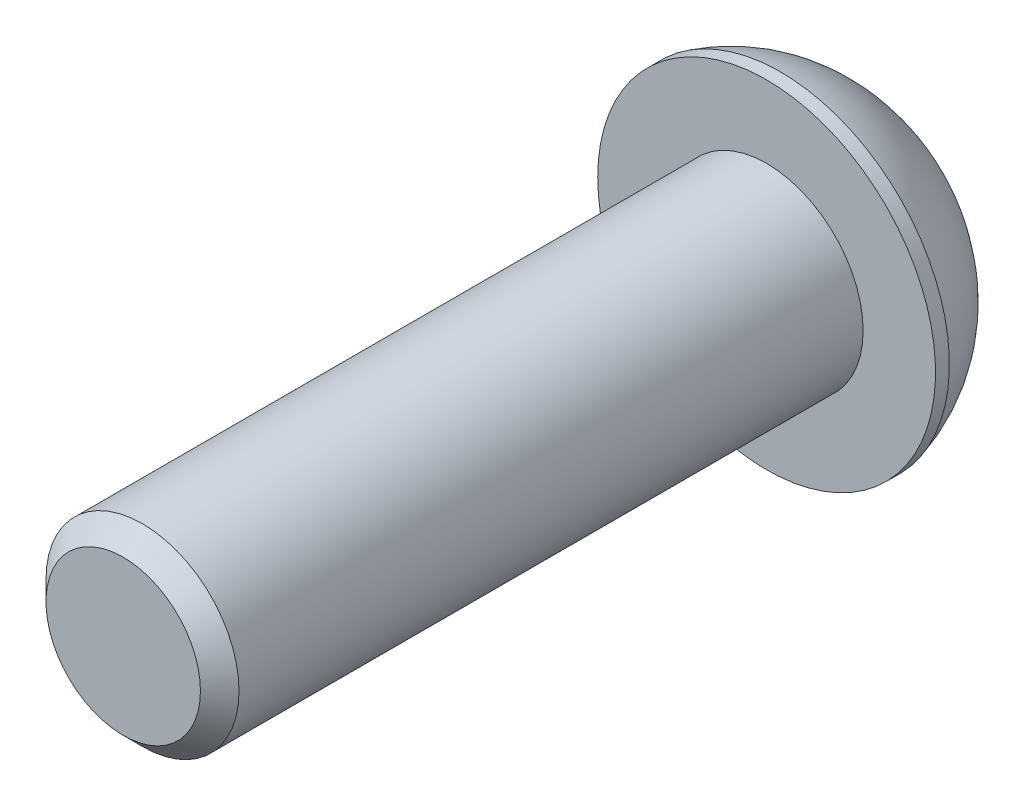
ISO-10303-21;
HEADER;
FILE_DESCRIPTION(('STEP AP214'),'2;1');
FILE_NAME('part.step','',(''),(''),'','','');
FILE_SCHEMA(('AUTOMOTIVE_DESIGN { 1 0 10303 214 1 1 1 1 }'));
ENDSEC;
DATA;
#1=APPLICATION_CONTEXT('core data for automotive mechanical design processes');
#2=APPLICATION_PROTOCOL_DEFINITION('international standard','automotive_design',2000,#1);
#3=PRODUCT_CONTEXT('',#1,'mechanical');
#4=PRODUCT('Part','Part','',(#3));
#5=PRODUCT_RELATED_PRODUCT_CATEGORY('part','',(#4));
#6=PRODUCT_DEFINITION_FORMATION('','',#4);
#7=PRODUCT_DEFINITION_CONTEXT('part definition',#1,'design');
#8=PRODUCT_DEFINITION('design','',#6,#7);
#9=PRODUCT_DEFINITION_SHAPE('','',#8);
#10=(LENGTH_UNIT() NAMED_UNIT(*) SI_UNIT(.MILLI.,.METRE.));
#11=(NAMED_UNIT(*) PLANE_ANGLE_UNIT() SI_UNIT($,.RADIAN.));
#12=(NAMED_UNIT(*) SI_UNIT($,.STERADIAN.) SOLID_ANGLE_UNIT());
#13=UNCERTAINTY_MEASURE_WITH_UNIT(LENGTH_MEASURE(1.E-05),#10,'distance_accuracy_value','');
#14=(GEOMETRIC_REPRESENTATION_CONTEXT(3) GLOBAL_UNCERTAINTY_ASSIGNED_CONTEXT((#13)) GLOBAL_UNIT_ASSIGNED_CONTEXT((#10,
#11,#12)) REPRESENTATION_CONTEXT('',''));
#15=CARTESIAN_POINT('',(0.,0.,0.));
#16=DIRECTION('',(0.,0.,1.));
#17=DIRECTION('',(1.,0.,0.));
#18=AXIS2_PLACEMENT_3D('',#15,#16,#17);
#19=CARTESIAN_POINT('',(0.,0.,-3.3));
#20=DIRECTION('',(0.,0.,1.));
#21=DIRECTION('',(1.,0.,0.));
#22=AXIS2_PLACEMENT_3D('',#19,#20,#21);
#23=PLANE('',#22);
#24=CARTESIAN_POINT('',(0.,0.,-3.3));
#25=DIRECTION('',(0.,0.,-1.));
#26=DIRECTION('',(-1.,0.,0.));
#27=AXIS2_PLACEMENT_3D('',#24,#25,#26);
#28=CIRCLE('',#27,3.04869256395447);
#29=CARTESIAN_POINT('',(-3.04869256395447,0.,-3.3));
#30=VERTEX_POINT('',#29);
#31=EDGE_CURVE('E141',#30,#30,#28,.T.);
#32=ORIENTED_EDGE('',*,*,#31,.T.);
#33=EDGE_LOOP('',(#32));
#34=FACE_BOUND('',#33,.T.);
#35=DIRECTION('',(-0.86602540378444,0.499999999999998,0.));
#36=VECTOR('',#35,1.);
#37=CARTESIAN_POINT('',(0.,2.30940107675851,-3.3));
#38=LINE('',#37,#36);
#39=CARTESIAN_POINT('',(2.,1.15470053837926,-3.3));
#40=VERTEX_POINT('',#39);
#41=CARTESIAN_POINT('',(0.,2.30940107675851,-3.3));
#42=VERTEX_POINT('',#41);
#43=EDGE_CURVE('E45',#40,#42,#38,.T.);
#44=ORIENTED_EDGE('',*,*,#43,.T.);
#45=DIRECTION('',(-0.866025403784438,-0.500000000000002,0.));
#46=VECTOR('',#45,1.);
#47=CARTESIAN_POINT('',(0.,2.30940107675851,-3.3));
#48=LINE('',#47,#46);
#49=CARTESIAN_POINT('',(-2.,1.15470053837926,-3.3));
#50=VERTEX_POINT('',#49);
#51=EDGE_CURVE('E85',#42,#50,#48,.T.);
#52=ORIENTED_EDGE('',*,*,#51,.T.);
#53=DIRECTION('',(0.,-1.,0.));
#54=VECTOR('',#53,1.);
#55=CARTESIAN_POINT('',(-2.,-1.15470053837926,-3.3));
#56=LINE('',#55,#54);
#57=CARTESIAN_POINT('',(-2.,-1.15470053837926,-3.3));
#58=VERTEX_POINT('',#57);
#59=EDGE_CURVE('E93',#50,#58,#56,.T.);
#60=ORIENTED_EDGE('',*,*,#59,.T.);
#61=DIRECTION('',(0.866025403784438,-0.500000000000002,0.));
#62=VECTOR('',#61,1.);
#63=CARTESIAN_POINT('',(0.,-2.30940107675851,-3.3));
#64=LINE('',#63,#62);
#65=CARTESIAN_POINT('',(0.,-2.30940107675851,-3.3));
#66=VERTEX_POINT('',#65);
#67=EDGE_CURVE('E111',#58,#66,#64,.T.);
#68=ORIENTED_EDGE('',*,*,#67,.T.);
#69=DIRECTION('',(0.86602540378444,0.499999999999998,0.));
#70=VECTOR('',#69,1.);
#71=CARTESIAN_POINT('',(0.,-2.30940107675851,-3.3));
#72=LINE('',#71,#70);
#73=CARTESIAN_POINT('',(2.,-1.15470053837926,-3.3));
#74=VERTEX_POINT('',#73);
#75=EDGE_CURVE('E114',#66,#74,#72,.T.);
#76=ORIENTED_EDGE('',*,*,#75,.T.);
#77=DIRECTION('',(0.,1.,0.));
#78=VECTOR('',#77,1.);
#79=CARTESIAN_POINT('',(2.,-1.15470053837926,-3.3));
#80=LINE('',#79,#78);
#81=EDGE_CURVE('E104',#74,#40,#80,.T.);
#82=ORIENTED_EDGE('',*,*,#81,.T.);
#83=EDGE_LOOP('',(#44,#52,#60,#68,#76,#82));
#84=FACE_BOUND('',#83,.T.);
#85=ADVANCED_FACE('F31',(#34,#84),#23,.F.);
#86=CARTESIAN_POINT('',(0.,0.,0.791612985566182));
#87=DIRECTION('',(0.,0.,-1.));
#88=DIRECTION('',(-1.,0.,0.));
#89=AXIS2_PLACEMENT_3D('',#86,#87,#88);
#90=DEGENERATE_TOROIDAL_SURFACE('',#89,0.686398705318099,4.72458771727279,.T.);
#91=ORIENTED_EDGE('',*,*,#31,.F.);
#92=EDGE_LOOP('',(#91));
#93=FACE_BOUND('',#92,.T.);
#94=CARTESIAN_POINT('',(0.,0.,-0.431200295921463));
#95=DIRECTION('',(0.,0.,-1.));
#96=DIRECTION('',(-1.,0.,0.));
#97=AXIS2_PLACEMENT_3D('',#94,#95,#96);
#98=CIRCLE('',#97,5.25);
#99=CARTESIAN_POINT('',(-5.25,0.,-0.431200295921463));
#100=VERTEX_POINT('',#99);
#101=EDGE_CURVE('E138',#100,#100,#98,.T.);
#102=ORIENTED_EDGE('',*,*,#101,.T.);
#103=EDGE_LOOP('',(#102));
#104=FACE_BOUND('',#103,.T.);
#105=ADVANCED_FACE('F160',(#93,#104),#90,.T.);
#106=CARTESIAN_POINT('',(0.,0.,0.));
#107=DIRECTION('',(0.,0.,-1.));
#108=DIRECTION('',(-1.,0.,0.));
#109=AXIS2_PLACEMENT_3D('',#106,#107,#108);
#110=CYLINDRICAL_SURFACE('',#109,5.25);
#111=ORIENTED_EDGE('',*,*,#101,.F.);
#112=EDGE_LOOP('',(#111));
#113=FACE_BOUND('',#112,.T.);
#114=CARTESIAN_POINT('',(0.,0.,0.));
#115=DIRECTION('',(0.,0.,-1.));
#116=DIRECTION('',(-1.,0.,0.));
#117=AXIS2_PLACEMENT_3D('',#114,#115,#116);
#118=CIRCLE('',#117,5.25);
#119=CARTESIAN_POINT('',(-5.25,0.,0.));
#120=VERTEX_POINT('',#119);
#121=EDGE_CURVE('E99',#120,#120,#118,.T.);
#122=ORIENTED_EDGE('',*,*,#121,.T.);
#123=EDGE_LOOP('',(#122));
#124=FACE_BOUND('',#123,.T.);
#125=ADVANCED_FACE('F165',(#113,#124),#110,.T.);
#126=CARTESIAN_POINT('',(0.,0.,0.));
#127=DIRECTION('',(0.,0.,-1.));
#128=DIRECTION('',(-1.,0.,0.));
#129=AXIS2_PLACEMENT_3D('',#126,#127,#128);
#130=PLANE('',#129);
#131=CARTESIAN_POINT('',(0.,0.,0.));
#132=DIRECTION('',(0.,0.,1.));
#133=DIRECTION('',(1.,0.,0.));
#134=AXIS2_PLACEMENT_3D('',#131,#132,#133);
#135=CIRCLE('',#134,3.);
#136=CARTESIAN_POINT('',(3.,0.,0.));
#137=VERTEX_POINT('',#136);
#138=EDGE_CURVE('E105',#137,#137,#135,.T.);
#139=ORIENTED_EDGE('',*,*,#138,.F.);
#140=EDGE_LOOP('',(#139));
#141=FACE_BOUND('',#140,.T.);
#142=ORIENTED_EDGE('',*,*,#121,.F.);
#143=EDGE_LOOP('',(#142));
#144=FACE_BOUND('',#143,.T.);
#145=ADVANCED_FACE('F173',(#141,#144),#130,.F.);
#146=CARTESIAN_POINT('',(0.,2.30940107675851,-1.22));
#147=DIRECTION('',(-0.499999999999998,-0.86602540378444,0.));
#148=DIRECTION('',(0.86602540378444,-0.499999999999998,0.));
#149=AXIS2_PLACEMENT_3D('',#146,#147,#148);
#150=PLANE('',#149);
#151=ORIENTED_EDGE('',*,*,#43,.F.);
#152=DIRECTION('',(0.,0.,-1.));
#153=VECTOR('',#152,1.);
#154=CARTESIAN_POINT('',(2.,1.15470053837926,-1.22));
#155=LINE('',#154,#153);
#156=CARTESIAN_POINT('',(2.,1.15470053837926,-1.22));
#157=VERTEX_POINT('',#156);
#158=EDGE_CURVE('E127',#157,#40,#155,.T.);
#159=ORIENTED_EDGE('',*,*,#158,.F.);
#160=DIRECTION('',(-0.86602540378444,0.499999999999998,0.));
#161=VECTOR('',#160,1.);
#162=CARTESIAN_POINT('',(0.,2.30940107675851,-1.22));
#163=LINE('',#162,#161);
#164=CARTESIAN_POINT('',(0.,2.30940107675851,-1.22));
#165=VERTEX_POINT('',#164);
#166=EDGE_CURVE('E98',#157,#165,#163,.T.);
#167=ORIENTED_EDGE('',*,*,#166,.T.);
#168=DIRECTION('',(0.,0.,-1.));
#169=VECTOR('',#168,1.);
#170=CARTESIAN_POINT('',(0.,2.30940107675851,-1.22));
#171=LINE('',#170,#169);
#172=EDGE_CURVE('E87',#165,#42,#171,.T.);
#173=ORIENTED_EDGE('',*,*,#172,.T.);
#174=EDGE_LOOP('',(#151,#159,#167,#173));
#175=FACE_BOUND('',#174,.T.);
#176=ADVANCED_FACE('F96',(#175),#150,.T.);
#177=CARTESIAN_POINT('',(0.,2.30940107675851,-1.22));
#178=DIRECTION('',(0.500000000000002,-0.866025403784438,0.));
#179=DIRECTION('',(0.866025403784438,0.500000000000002,0.));
#180=AXIS2_PLACEMENT_3D('',#177,#178,#179);
#181=PLANE('',#180);
#182=ORIENTED_EDGE('',*,*,#51,.F.);
#183=ORIENTED_EDGE('',*,*,#172,.F.);
#184=DIRECTION('',(-0.866025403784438,-0.500000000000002,0.));
#185=VECTOR('',#184,1.);
#186=CARTESIAN_POINT('',(0.,2.30940107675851,-1.22));
#187=LINE('',#186,#185);
#188=CARTESIAN_POINT('',(-2.,1.15470053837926,-1.22));
#189=VERTEX_POINT('',#188);
#190=EDGE_CURVE('E118',#165,#189,#187,.T.);
#191=ORIENTED_EDGE('',*,*,#190,.T.);
#192=DIRECTION('',(0.,0.,-1.));
#193=VECTOR('',#192,1.);
#194=CARTESIAN_POINT('',(-2.,1.15470053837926,-1.22));
#195=LINE('',#194,#193);
#196=EDGE_CURVE('E89',#189,#50,#195,.T.);
#197=ORIENTED_EDGE('',*,*,#196,.T.);
#198=EDGE_LOOP('',(#182,#183,#191,#197));
#199=FACE_BOUND('',#198,.T.);
#200=ADVANCED_FACE('F86',(#199),#181,.T.);
#201=CARTESIAN_POINT('',(-2.,-1.15470053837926,-1.22));
#202=DIRECTION('',(1.,0.,0.));
#203=DIRECTION('',(0.,0.,-1.));
#204=AXIS2_PLACEMENT_3D('',#201,#202,#203);
#205=PLANE('',#204);
#206=ORIENTED_EDGE('',*,*,#59,.F.);
#207=ORIENTED_EDGE('',*,*,#196,.F.);
#208=DIRECTION('',(0.,-1.,0.));
#209=VECTOR('',#208,1.);
#210=CARTESIAN_POINT('',(-2.,-1.15470053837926,-1.22));
#211=LINE('',#210,#209);
#212=CARTESIAN_POINT('',(-2.,-1.15470053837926,-1.22));
#213=VERTEX_POINT('',#212);
#214=EDGE_CURVE('E120',#189,#213,#211,.T.);
#215=ORIENTED_EDGE('',*,*,#214,.T.);
#216=DIRECTION('',(0.,0.,-1.));
#217=VECTOR('',#216,1.);
#218=CARTESIAN_POINT('',(-2.,-1.15470053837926,-1.22));
#219=LINE('',#218,#217);
#220=EDGE_CURVE('E133',#213,#58,#219,.T.);
#221=ORIENTED_EDGE('',*,*,#220,.T.);
#222=EDGE_LOOP('',(#206,#207,#215,#221));
#223=FACE_BOUND('',#222,.T.);
#224=ADVANCED_FACE('F188',(#223),#205,.T.);
#225=CARTESIAN_POINT('',(0.,-2.30940107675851,-1.22));
#226=DIRECTION('',(0.500000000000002,0.866025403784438,0.));
#227=DIRECTION('',(-0.866025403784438,0.500000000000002,0.));
#228=AXIS2_PLACEMENT_3D('',#225,#226,#227);
#229=PLANE('',#228);
#230=ORIENTED_EDGE('',*,*,#67,.F.);
#231=ORIENTED_EDGE('',*,*,#220,.F.);
#232=DIRECTION('',(0.866025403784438,-0.500000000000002,0.));
#233=VECTOR('',#232,1.);
#234=CARTESIAN_POINT('',(0.,-2.30940107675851,-1.22));
#235=LINE('',#234,#233);
#236=CARTESIAN_POINT('',(0.,-2.30940107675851,-1.22));
#237=VERTEX_POINT('',#236);
#238=EDGE_CURVE('E122',#213,#237,#235,.T.);
#239=ORIENTED_EDGE('',*,*,#238,.T.);
#240=DIRECTION('',(0.,0.,-1.));
#241=VECTOR('',#240,1.);
#242=CARTESIAN_POINT('',(0.,-2.30940107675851,-1.22));
#243=LINE('',#242,#241);
#244=EDGE_CURVE('E131',#237,#66,#243,.T.);
#245=ORIENTED_EDGE('',*,*,#244,.T.);
#246=EDGE_LOOP('',(#230,#231,#239,#245));
#247=FACE_BOUND('',#246,.T.);
#248=ADVANCED_FACE('F191',(#247),#229,.T.);
#249=CARTESIAN_POINT('',(0.,-2.30940107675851,-1.22));
#250=DIRECTION('',(-0.499999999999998,0.86602540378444,0.));
#251=DIRECTION('',(-0.86602540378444,-0.499999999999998,0.));
#252=AXIS2_PLACEMENT_3D('',#249,#250,#251);
#253=PLANE('',#252);
#254=ORIENTED_EDGE('',*,*,#75,.F.);
#255=ORIENTED_EDGE('',*,*,#244,.F.);
#256=DIRECTION('',(0.86602540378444,0.499999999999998,0.));
#257=VECTOR('',#256,1.);
#258=CARTESIAN_POINT('',(0.,-2.30940107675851,-1.22));
#259=LINE('',#258,#257);
#260=CARTESIAN_POINT('',(2.,-1.15470053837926,-1.22));
#261=VERTEX_POINT('',#260);
#262=EDGE_CURVE('E124',#237,#261,#259,.T.);
#263=ORIENTED_EDGE('',*,*,#262,.T.);
#264=DIRECTION('',(0.,0.,-1.));
#265=VECTOR('',#264,1.);
#266=CARTESIAN_POINT('',(2.,-1.15470053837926,-1.22));
#267=LINE('',#266,#265);
#268=EDGE_CURVE('E129',#261,#74,#267,.T.);
#269=ORIENTED_EDGE('',*,*,#268,.T.);
#270=EDGE_LOOP('',(#254,#255,#263,#269));
#271=FACE_BOUND('',#270,.T.);
#272=ADVANCED_FACE('F195',(#271),#253,.T.);
#273=CARTESIAN_POINT('',(2.,-1.15470053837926,-1.22));
#274=DIRECTION('',(-1.,0.,0.));
#275=DIRECTION('',(0.,0.,1.));
#276=AXIS2_PLACEMENT_3D('',#273,#274,#275);
#277=PLANE('',#276);
#278=ORIENTED_EDGE('',*,*,#81,.F.);
#279=ORIENTED_EDGE('',*,*,#268,.F.);
#280=DIRECTION('',(0.,1.,0.));
#281=VECTOR('',#280,1.);
#282=CARTESIAN_POINT('',(2.,-1.15470053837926,-1.22));
#283=LINE('',#282,#281);
#284=EDGE_CURVE('E52',#261,#157,#283,.T.);
#285=ORIENTED_EDGE('',*,*,#284,.T.);
#286=ORIENTED_EDGE('',*,*,#158,.T.);
#287=EDGE_LOOP('',(#278,#279,#285,#286));
#288=FACE_BOUND('',#287,.T.);
#289=ADVANCED_FACE('F199',(#288),#277,.T.);
#290=CARTESIAN_POINT('',(2.,1.15470053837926,-1.22));
#291=DIRECTION('',(0.,0.,1.));
#292=DIRECTION('',(1.,0.,0.));
#293=AXIS2_PLACEMENT_3D('',#290,#291,#292);
#294=PLANE('',#293);
#295=ORIENTED_EDGE('',*,*,#166,.F.);
#296=ORIENTED_EDGE('',*,*,#284,.F.);
#297=ORIENTED_EDGE('',*,*,#262,.F.);
#298=ORIENTED_EDGE('',*,*,#238,.F.);
#299=ORIENTED_EDGE('',*,*,#214,.F.);
#300=ORIENTED_EDGE('',*,*,#190,.F.);
#301=EDGE_LOOP('',(#295,#296,#297,#298,#299,#300));
#302=FACE_BOUND('',#301,.T.);
#303=ADVANCED_FACE('F203',(#302),#294,.F.);
#304=CARTESIAN_POINT('',(0.,0.,20.));
#305=DIRECTION('',(0.,0.,1.));
#306=DIRECTION('',(1.,0.,0.));
#307=AXIS2_PLACEMENT_3D('',#304,#305,#306);
#308=PLANE('',#307);
#309=CARTESIAN_POINT('',(0.,0.,20.));
#310=DIRECTION('',(0.,0.,1.));
#311=DIRECTION('',(1.,0.,0.));
#312=AXIS2_PLACEMENT_3D('',#309,#310,#311);
#313=CIRCLE('',#312,2.4);
#314=CARTESIAN_POINT('',(2.4,0.,20.));
#315=VERTEX_POINT('',#314);
#316=EDGE_CURVE('E38',#315,#315,#313,.T.);
#317=ORIENTED_EDGE('',*,*,#316,.T.);
#318=EDGE_LOOP('',(#317));
#319=FACE_BOUND('',#318,.T.);
#320=ADVANCED_FACE('F146',(#319),#308,.T.);
#321=CARTESIAN_POINT('',(0.,0.,0.));
#322=DIRECTION('',(0.,0.,1.));
#323=DIRECTION('',(1.,0.,0.));
#324=AXIS2_PLACEMENT_3D('',#321,#322,#323);
#325=CYLINDRICAL_SURFACE('',#324,3.);
#326=CARTESIAN_POINT('',(0.,0.,19.4));
#327=DIRECTION('',(0.,0.,1.));
#328=DIRECTION('',(1.,0.,0.));
#329=AXIS2_PLACEMENT_3D('',#326,#327,#328);
#330=CIRCLE('',#329,3.);
#331=CARTESIAN_POINT('',(3.,0.,19.4));
#332=VERTEX_POINT('',#331);
#333=EDGE_CURVE('E11',#332,#332,#330,.F.);
#334=ORIENTED_EDGE('',*,*,#333,.T.);
#335=EDGE_LOOP('',(#334));
#336=FACE_BOUND('',#335,.T.);
#337=ORIENTED_EDGE('',*,*,#138,.T.);
#338=EDGE_LOOP('',(#337));
#339=FACE_BOUND('',#338,.T.);
#340=ADVANCED_FACE('F150',(#336,#339),#325,.T.);
#341=CARTESIAN_POINT('',(0.,0.,20.));
#342=DIRECTION('',(0.,0.,-1.));
#343=DIRECTION('',(-1.,0.,0.));
#344=AXIS2_PLACEMENT_3D('',#341,#342,#343);
#345=CONICAL_SURFACE('',#344,2.4,0.785398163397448);
#346=ORIENTED_EDGE('',*,*,#333,.F.);
#347=EDGE_LOOP('',(#346));
#348=FACE_BOUND('',#347,.T.);
#349=ORIENTED_EDGE('',*,*,#316,.F.);
#350=EDGE_LOOP('',(#349));
#351=FACE_BOUND('',#350,.T.);
#352=ADVANCED_FACE('F148',(#348,#351),#345,.T.);
#353=CLOSED_SHELL('',(#85,#105,#125,#145,#176,#200,#224,#248,#272,#289,#303,#320,#340,#352));
#354=MANIFOLD_SOLID_BREP('B2',#353);
#355=ADVANCED_BREP_SHAPE_REPRESENTATION('',(#18,#354),#14);
#356=SHAPE_DEFINITION_REPRESENTATION(#9,#355);
ENDSEC;
END-ISO-10303-21;
